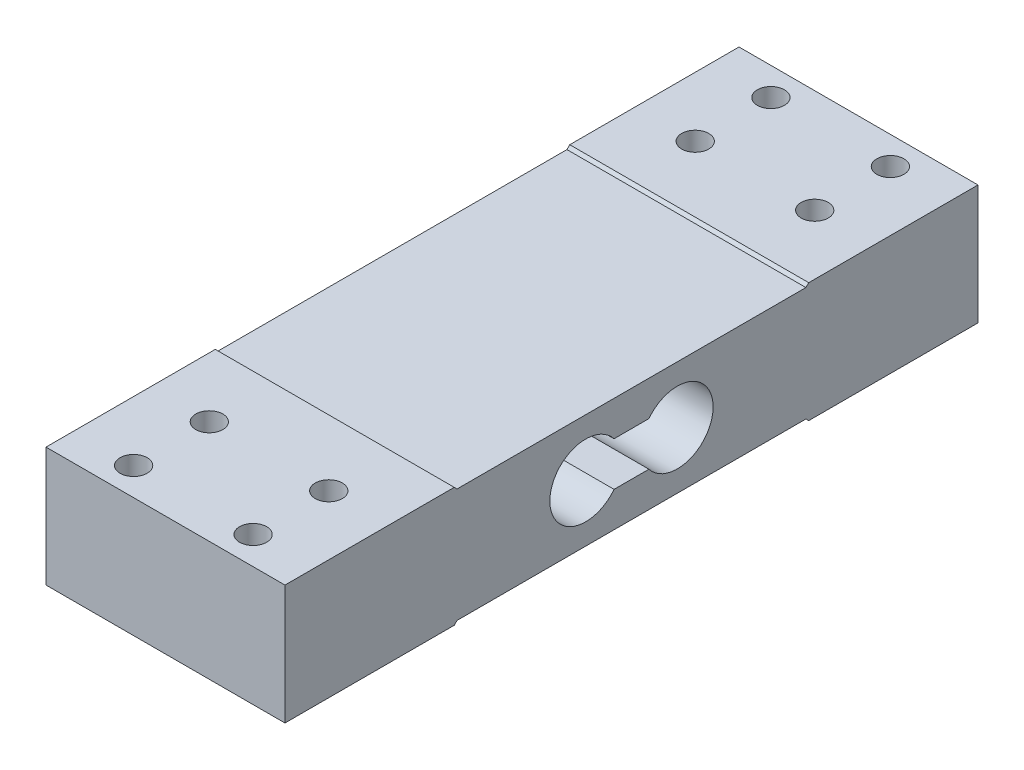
from build123d import *

# Parameters (mm, degrees)
EXTRUDE1_DEPTH       = 30
M8_TAPPED_HOLE1_D    = 6.8
LPATTERN1_COUNT      = 2
LPATTERN1_PITCH      = 30
LPATTERN1_COUNT_DIR2 = 2
LPATTERN1_PITCH_DIR2 = 19
M8_TAPPED_HOLE2_D    = 6.8
LPATTERN2_COUNT      = 2
LPATTERN2_PITCH      = 30
LPATTERN2_COUNT_DIR2 = 2
LPATTERN2_PITCH_DIR2 = 19
EXTRUDE2_DEPTH       = 187.483243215


with BuildPart() as part:
    # Sketch1 → Extrude1 (new, symmetric)
    with BuildSketch(Plane(origin=(0, 0, 0), x_dir=(0, 0, -1), z_dir=(1, 0, 0))):
        Polygon((0, 0), (42.5, 0), (43.207106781, 0.707106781), (130.792893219, 0.707106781), (131.5, 0), (174, 0), (174, 30), (131.5, 30), (130.792893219, 29.292893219), (43.207106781, 29.292893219), (42.5, 30), (0, 30), align=None)
    extrude(amount=EXTRUDE1_DEPTH, both=True)

    # M8 Tapped Hole1 (through all)
    with Locations(Plane(origin=(-15, 30, -7), x_dir=(0, 0, 1), z_dir=(0, 1, 0))):
        with Locations((0, 0)):
            m8_tapped_hole1 = Hole(M8_TAPPED_HOLE1_D / 2)

    # LPattern1: M8 Tapped Hole1 2 × 2
    with Locations(*[(i * LPATTERN1_PITCH, 0, -j * LPATTERN1_PITCH_DIR2) for i in range(LPATTERN1_COUNT) for j in range(LPATTERN1_COUNT_DIR2) if (i, j) != (0, 0)]):
        add(m8_tapped_hole1, mode=Mode.SUBTRACT)

    # M8 Tapped Hole2 (through all)
    with Locations(Plane(origin=(-15, 0, -167), x_dir=(0, 0, -1), z_dir=(0, -1, 0))):
        with Locations((0, 0)):
            m8_tapped_hole2 = Hole(M8_TAPPED_HOLE2_D / 2)

    # LPattern2: M8 Tapped Hole2 2 × 2
    with Locations(*[(i * LPATTERN2_PITCH, 0, j * LPATTERN2_PITCH_DIR2) for i in range(LPATTERN2_COUNT) for j in range(LPATTERN2_COUNT_DIR2) if (i, j) != (0, 0)]):
        add(m8_tapped_hole2, mode=Mode.SUBTRACT)

    # Sketch12 → Extrude2 (cut, through all)
    with BuildSketch(Plane(origin=(30, 0, 0), x_dir=(0, 0, -1), z_dir=(1, 0, 0))):
        with BuildLine():
            Line((82.623903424, 20.5), (91.376096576, 20.5))
            ThreePointArc((91.376096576, 20.5), (107.5, 15), (91.376096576, 9.5))
            Line((91.376096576, 9.5), (82.623903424, 9.5))
            ThreePointArc((82.623903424, 9.5), (66.5, 15), (82.623903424, 20.5))
        make_face()
    extrude(amount=-EXTRUDE2_DEPTH, mode=Mode.SUBTRACT)


solid = part.part
